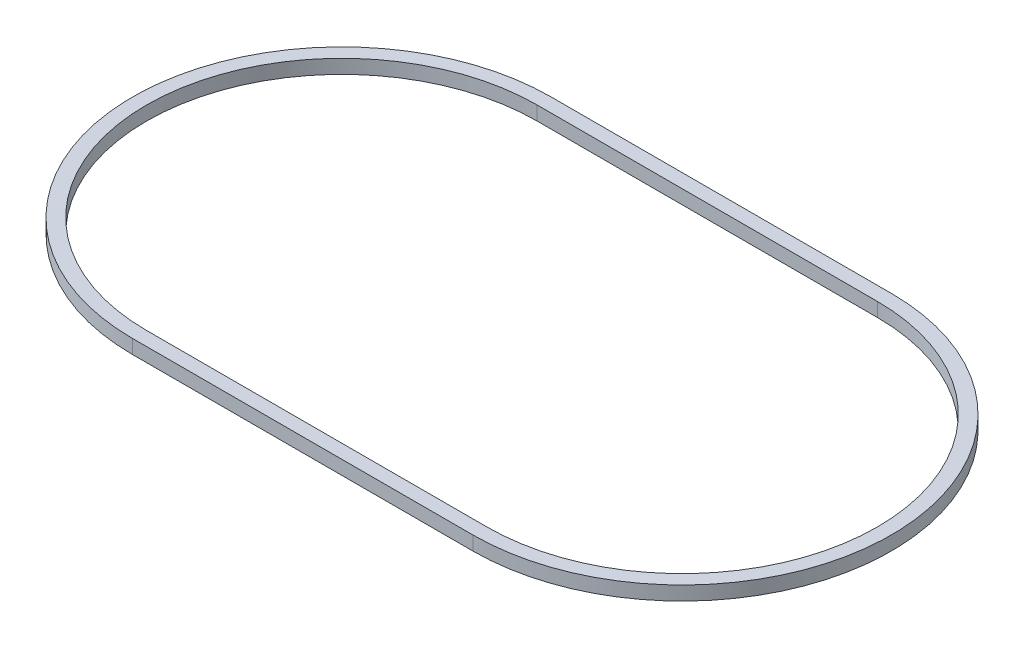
ISO-10303-21;
HEADER;
FILE_DESCRIPTION(('STEP AP214'),'2;1');
FILE_NAME('part.step','',(''),(''),'','','');
FILE_SCHEMA(('AUTOMOTIVE_DESIGN { 1 0 10303 214 1 1 1 1 }'));
ENDSEC;
DATA;
#1=APPLICATION_CONTEXT('core data for automotive mechanical design processes');
#2=APPLICATION_PROTOCOL_DEFINITION('international standard','automotive_design',2000,#1);
#3=PRODUCT_CONTEXT('',#1,'mechanical');
#4=PRODUCT('Part','Part','',(#3));
#5=PRODUCT_RELATED_PRODUCT_CATEGORY('part','',(#4));
#6=PRODUCT_DEFINITION_FORMATION('','',#4);
#7=PRODUCT_DEFINITION_CONTEXT('part definition',#1,'design');
#8=PRODUCT_DEFINITION('design','',#6,#7);
#9=PRODUCT_DEFINITION_SHAPE('','',#8);
#10=(LENGTH_UNIT() NAMED_UNIT(*) SI_UNIT(.MILLI.,.METRE.));
#11=(NAMED_UNIT(*) PLANE_ANGLE_UNIT() SI_UNIT($,.RADIAN.));
#12=(NAMED_UNIT(*) SI_UNIT($,.STERADIAN.) SOLID_ANGLE_UNIT());
#13=UNCERTAINTY_MEASURE_WITH_UNIT(LENGTH_MEASURE(1.E-05),#10,'distance_accuracy_value','');
#14=(GEOMETRIC_REPRESENTATION_CONTEXT(3) GLOBAL_UNCERTAINTY_ASSIGNED_CONTEXT((#13)) GLOBAL_UNIT_ASSIGNED_CONTEXT((#10,
#11,#12)) REPRESENTATION_CONTEXT('',''));
#15=CARTESIAN_POINT('',(0.,0.,0.));
#16=DIRECTION('',(0.,0.,1.));
#17=DIRECTION('',(1.,0.,0.));
#18=AXIS2_PLACEMENT_3D('',#15,#16,#17);
#19=CARTESIAN_POINT('',(30.5,2.5,0.));
#20=DIRECTION('',(0.,1.,0.));
#21=DIRECTION('',(0.,0.,1.));
#22=AXIS2_PLACEMENT_3D('',#19,#20,#21);
#23=PLANE('',#22);
#24=CARTESIAN_POINT('',(30.5,2.5,0.));
#25=DIRECTION('',(0.,1.,0.));
#26=DIRECTION('',(0.,0.,1.));
#27=AXIS2_PLACEMENT_3D('',#24,#25,#26);
#28=CIRCLE('',#27,37.5);
#29=CARTESIAN_POINT('',(30.5,2.5,37.5));
#30=VERTEX_POINT('',#29);
#31=CARTESIAN_POINT('',(30.5,2.5,-37.5));
#32=VERTEX_POINT('',#31);
#33=EDGE_CURVE('E153',#30,#32,#28,.T.);
#34=ORIENTED_EDGE('',*,*,#33,.T.);
#35=DIRECTION('',(-1.,0.,0.));
#36=VECTOR('',#35,1.);
#37=CARTESIAN_POINT('',(30.5,2.5,-37.5));
#38=LINE('',#37,#36);
#39=CARTESIAN_POINT('',(-30.5,2.5,-37.5));
#40=VERTEX_POINT('',#39);
#41=EDGE_CURVE('E157',#32,#40,#38,.T.);
#42=ORIENTED_EDGE('',*,*,#41,.T.);
#43=CARTESIAN_POINT('',(-30.5,2.5,0.));
#44=DIRECTION('',(0.,1.,0.));
#45=DIRECTION('',(0.,0.,1.));
#46=AXIS2_PLACEMENT_3D('',#43,#44,#45);
#47=CIRCLE('',#46,37.5);
#48=CARTESIAN_POINT('',(-30.5,2.5,37.5));
#49=VERTEX_POINT('',#48);
#50=EDGE_CURVE('E161',#40,#49,#47,.T.);
#51=ORIENTED_EDGE('',*,*,#50,.T.);
#52=DIRECTION('',(1.,0.,0.));
#53=VECTOR('',#52,1.);
#54=CARTESIAN_POINT('',(30.5,2.5,37.5));
#55=LINE('',#54,#53);
#56=EDGE_CURVE('E164',#49,#30,#55,.T.);
#57=ORIENTED_EDGE('',*,*,#56,.T.);
#58=EDGE_LOOP('',(#34,#42,#51,#57));
#59=FACE_BOUND('',#58,.T.);
#60=DIRECTION('',(-1.,0.,0.));
#61=VECTOR('',#60,1.);
#62=CARTESIAN_POINT('',(30.5,2.5,-35.));
#63=LINE('',#62,#61);
#64=CARTESIAN_POINT('',(30.5,2.5,-35.));
#65=VERTEX_POINT('',#64);
#66=CARTESIAN_POINT('',(-30.5,2.5,-35.));
#67=VERTEX_POINT('',#66);
#68=EDGE_CURVE('E114',#65,#67,#63,.T.);
#69=ORIENTED_EDGE('',*,*,#68,.F.);
#70=CARTESIAN_POINT('',(30.5,2.5,0.));
#71=DIRECTION('',(0.,1.,0.));
#72=DIRECTION('',(0.,0.,1.));
#73=AXIS2_PLACEMENT_3D('',#70,#71,#72);
#74=CIRCLE('',#73,35.);
#75=CARTESIAN_POINT('',(30.5,2.5,35.));
#76=VERTEX_POINT('',#75);
#77=EDGE_CURVE('E105',#76,#65,#74,.T.);
#78=ORIENTED_EDGE('',*,*,#77,.F.);
#79=DIRECTION('',(1.,0.,0.));
#80=VECTOR('',#79,1.);
#81=CARTESIAN_POINT('',(30.5,2.5,35.));
#82=LINE('',#81,#80);
#83=CARTESIAN_POINT('',(-30.5,2.5,35.));
#84=VERTEX_POINT('',#83);
#85=EDGE_CURVE('E131',#84,#76,#82,.T.);
#86=ORIENTED_EDGE('',*,*,#85,.F.);
#87=CARTESIAN_POINT('',(-30.5,2.5,0.));
#88=DIRECTION('',(0.,1.,0.));
#89=DIRECTION('',(0.,0.,1.));
#90=AXIS2_PLACEMENT_3D('',#87,#88,#89);
#91=CIRCLE('',#90,35.);
#92=EDGE_CURVE('E127',#67,#84,#91,.T.);
#93=ORIENTED_EDGE('',*,*,#92,.F.);
#94=EDGE_LOOP('',(#69,#78,#86,#93));
#95=FACE_BOUND('',#94,.T.);
#96=ADVANCED_FACE('F39',(#59,#95),#23,.T.);
#97=CARTESIAN_POINT('',(30.5,0.,0.));
#98=DIRECTION('',(0.,1.,0.));
#99=DIRECTION('',(0.,0.,1.));
#100=AXIS2_PLACEMENT_3D('',#97,#98,#99);
#101=PLANE('',#100);
#102=CARTESIAN_POINT('',(30.5,0.,0.));
#103=DIRECTION('',(0.,1.,0.));
#104=DIRECTION('',(0.,0.,1.));
#105=AXIS2_PLACEMENT_3D('',#102,#103,#104);
#106=CIRCLE('',#105,37.5);
#107=CARTESIAN_POINT('',(30.5,0.,37.5));
#108=VERTEX_POINT('',#107);
#109=CARTESIAN_POINT('',(30.5,0.,-37.5));
#110=VERTEX_POINT('',#109);
#111=EDGE_CURVE('E123',#108,#110,#106,.T.);
#112=ORIENTED_EDGE('',*,*,#111,.F.);
#113=DIRECTION('',(1.,0.,0.));
#114=VECTOR('',#113,1.);
#115=CARTESIAN_POINT('',(30.5,0.,37.5));
#116=LINE('',#115,#114);
#117=CARTESIAN_POINT('',(-30.5,0.,37.5));
#118=VERTEX_POINT('',#117);
#119=EDGE_CURVE('E158',#118,#108,#116,.T.);
#120=ORIENTED_EDGE('',*,*,#119,.F.);
#121=CARTESIAN_POINT('',(-30.5,0.,0.));
#122=DIRECTION('',(0.,1.,0.));
#123=DIRECTION('',(0.,0.,1.));
#124=AXIS2_PLACEMENT_3D('',#121,#122,#123);
#125=CIRCLE('',#124,37.5);
#126=CARTESIAN_POINT('',(-30.5,0.,-37.5));
#127=VERTEX_POINT('',#126);
#128=EDGE_CURVE('E174',#127,#118,#125,.T.);
#129=ORIENTED_EDGE('',*,*,#128,.F.);
#130=DIRECTION('',(-1.,0.,0.));
#131=VECTOR('',#130,1.);
#132=CARTESIAN_POINT('',(30.5,0.,-37.5));
#133=LINE('',#132,#131);
#134=EDGE_CURVE('E171',#110,#127,#133,.T.);
#135=ORIENTED_EDGE('',*,*,#134,.F.);
#136=EDGE_LOOP('',(#112,#120,#129,#135));
#137=FACE_BOUND('',#136,.T.);
#138=CARTESIAN_POINT('',(30.5,0.,0.));
#139=DIRECTION('',(0.,1.,0.));
#140=DIRECTION('',(0.,0.,1.));
#141=AXIS2_PLACEMENT_3D('',#138,#139,#140);
#142=CIRCLE('',#141,35.);
#143=CARTESIAN_POINT('',(30.5,0.,35.));
#144=VERTEX_POINT('',#143);
#145=CARTESIAN_POINT('',(30.5,0.,-35.));
#146=VERTEX_POINT('',#145);
#147=EDGE_CURVE('E63',#144,#146,#142,.T.);
#148=ORIENTED_EDGE('',*,*,#147,.T.);
#149=DIRECTION('',(-1.,0.,0.));
#150=VECTOR('',#149,1.);
#151=CARTESIAN_POINT('',(30.5,0.,-35.));
#152=LINE('',#151,#150);
#153=CARTESIAN_POINT('',(-30.5,0.,-35.));
#154=VERTEX_POINT('',#153);
#155=EDGE_CURVE('E121',#146,#154,#152,.T.);
#156=ORIENTED_EDGE('',*,*,#155,.T.);
#157=CARTESIAN_POINT('',(-30.5,0.,0.));
#158=DIRECTION('',(0.,1.,0.));
#159=DIRECTION('',(0.,0.,1.));
#160=AXIS2_PLACEMENT_3D('',#157,#158,#159);
#161=CIRCLE('',#160,35.);
#162=CARTESIAN_POINT('',(-30.5,0.,35.));
#163=VERTEX_POINT('',#162);
#164=EDGE_CURVE('E140',#154,#163,#161,.T.);
#165=ORIENTED_EDGE('',*,*,#164,.T.);
#166=DIRECTION('',(1.,0.,0.));
#167=VECTOR('',#166,1.);
#168=CARTESIAN_POINT('',(30.5,0.,35.));
#169=LINE('',#168,#167);
#170=EDGE_CURVE('E115',#163,#144,#169,.T.);
#171=ORIENTED_EDGE('',*,*,#170,.T.);
#172=EDGE_LOOP('',(#148,#156,#165,#171));
#173=FACE_BOUND('',#172,.T.);
#174=ADVANCED_FACE('F197',(#137,#173),#101,.F.);
#175=CARTESIAN_POINT('',(30.5,2.5,0.));
#176=DIRECTION('',(0.,-1.,0.));
#177=DIRECTION('',(0.,0.,-1.));
#178=AXIS2_PLACEMENT_3D('',#175,#176,#177);
#179=CYLINDRICAL_SURFACE('',#178,37.5);
#180=ORIENTED_EDGE('',*,*,#111,.T.);
#181=DIRECTION('',(0.,-1.,0.));
#182=VECTOR('',#181,1.);
#183=CARTESIAN_POINT('',(30.5,2.5,-37.5));
#184=LINE('',#183,#182);
#185=EDGE_CURVE('E11',#32,#110,#184,.T.);
#186=ORIENTED_EDGE('',*,*,#185,.F.);
#187=ORIENTED_EDGE('',*,*,#33,.F.);
#188=DIRECTION('',(0.,-1.,0.));
#189=VECTOR('',#188,1.);
#190=CARTESIAN_POINT('',(30.5,2.5,37.5));
#191=LINE('',#190,#189);
#192=EDGE_CURVE('E167',#30,#108,#191,.T.);
#193=ORIENTED_EDGE('',*,*,#192,.T.);
#194=EDGE_LOOP('',(#180,#186,#187,#193));
#195=FACE_BOUND('',#194,.T.);
#196=ADVANCED_FACE('F41',(#195),#179,.T.);
#197=CARTESIAN_POINT('',(30.5,2.5,-37.5));
#198=DIRECTION('',(0.,0.,1.));
#199=DIRECTION('',(1.,0.,0.));
#200=AXIS2_PLACEMENT_3D('',#197,#198,#199);
#201=PLANE('',#200);
#202=ORIENTED_EDGE('',*,*,#134,.T.);
#203=DIRECTION('',(0.,-1.,0.));
#204=VECTOR('',#203,1.);
#205=CARTESIAN_POINT('',(-30.5,2.5,-37.5));
#206=LINE('',#205,#204);
#207=EDGE_CURVE('E48',#40,#127,#206,.T.);
#208=ORIENTED_EDGE('',*,*,#207,.F.);
#209=ORIENTED_EDGE('',*,*,#41,.F.);
#210=ORIENTED_EDGE('',*,*,#185,.T.);
#211=EDGE_LOOP('',(#202,#208,#209,#210));
#212=FACE_BOUND('',#211,.T.);
#213=ADVANCED_FACE('F207',(#212),#201,.F.);
#214=CARTESIAN_POINT('',(-30.5,2.5,0.));
#215=DIRECTION('',(0.,-1.,0.));
#216=DIRECTION('',(0.,0.,-1.));
#217=AXIS2_PLACEMENT_3D('',#214,#215,#216);
#218=CYLINDRICAL_SURFACE('',#217,37.5);
#219=ORIENTED_EDGE('',*,*,#128,.T.);
#220=DIRECTION('',(0.,-1.,0.));
#221=VECTOR('',#220,1.);
#222=CARTESIAN_POINT('',(-30.5,2.5,37.5));
#223=LINE('',#222,#221);
#224=EDGE_CURVE('E182',#49,#118,#223,.T.);
#225=ORIENTED_EDGE('',*,*,#224,.F.);
#226=ORIENTED_EDGE('',*,*,#50,.F.);
#227=ORIENTED_EDGE('',*,*,#207,.T.);
#228=EDGE_LOOP('',(#219,#225,#226,#227));
#229=FACE_BOUND('',#228,.T.);
#230=ADVANCED_FACE('F191',(#229),#218,.T.);
#231=CARTESIAN_POINT('',(30.5,2.5,37.5));
#232=DIRECTION('',(0.,0.,-1.));
#233=DIRECTION('',(-1.,0.,0.));
#234=AXIS2_PLACEMENT_3D('',#231,#232,#233);
#235=PLANE('',#234);
#236=ORIENTED_EDGE('',*,*,#119,.T.);
#237=ORIENTED_EDGE('',*,*,#192,.F.);
#238=ORIENTED_EDGE('',*,*,#56,.F.);
#239=ORIENTED_EDGE('',*,*,#224,.T.);
#240=EDGE_LOOP('',(#236,#237,#238,#239));
#241=FACE_BOUND('',#240,.T.);
#242=ADVANCED_FACE('F201',(#241),#235,.F.);
#243=CARTESIAN_POINT('',(30.5,2.5,0.));
#244=DIRECTION('',(0.,-1.,0.));
#245=DIRECTION('',(0.,0.,-1.));
#246=AXIS2_PLACEMENT_3D('',#243,#244,#245);
#247=CYLINDRICAL_SURFACE('',#246,35.);
#248=ORIENTED_EDGE('',*,*,#147,.F.);
#249=DIRECTION('',(0.,-1.,0.));
#250=VECTOR('',#249,1.);
#251=CARTESIAN_POINT('',(30.5,2.5,35.));
#252=LINE('',#251,#250);
#253=EDGE_CURVE('E109',#76,#144,#252,.T.);
#254=ORIENTED_EDGE('',*,*,#253,.F.);
#255=ORIENTED_EDGE('',*,*,#77,.T.);
#256=DIRECTION('',(0.,-1.,0.));
#257=VECTOR('',#256,1.);
#258=CARTESIAN_POINT('',(30.5,2.5,-35.));
#259=LINE('',#258,#257);
#260=EDGE_CURVE('E108',#65,#146,#259,.T.);
#261=ORIENTED_EDGE('',*,*,#260,.T.);
#262=EDGE_LOOP('',(#248,#254,#255,#261));
#263=FACE_BOUND('',#262,.T.);
#264=ADVANCED_FACE('F107',(#263),#247,.F.);
#265=CARTESIAN_POINT('',(30.5,2.5,-35.));
#266=DIRECTION('',(0.,0.,1.));
#267=DIRECTION('',(1.,0.,0.));
#268=AXIS2_PLACEMENT_3D('',#265,#266,#267);
#269=PLANE('',#268);
#270=ORIENTED_EDGE('',*,*,#155,.F.);
#271=ORIENTED_EDGE('',*,*,#260,.F.);
#272=ORIENTED_EDGE('',*,*,#68,.T.);
#273=DIRECTION('',(0.,-1.,0.));
#274=VECTOR('',#273,1.);
#275=CARTESIAN_POINT('',(-30.5,2.5,-35.));
#276=LINE('',#275,#274);
#277=EDGE_CURVE('E124',#67,#154,#276,.T.);
#278=ORIENTED_EDGE('',*,*,#277,.T.);
#279=EDGE_LOOP('',(#270,#271,#272,#278));
#280=FACE_BOUND('',#279,.T.);
#281=ADVANCED_FACE('F118',(#280),#269,.T.);
#282=CARTESIAN_POINT('',(-30.5,2.5,0.));
#283=DIRECTION('',(0.,-1.,0.));
#284=DIRECTION('',(0.,0.,-1.));
#285=AXIS2_PLACEMENT_3D('',#282,#283,#284);
#286=CYLINDRICAL_SURFACE('',#285,35.);
#287=ORIENTED_EDGE('',*,*,#164,.F.);
#288=ORIENTED_EDGE('',*,*,#277,.F.);
#289=ORIENTED_EDGE('',*,*,#92,.T.);
#290=DIRECTION('',(0.,-1.,0.));
#291=VECTOR('',#290,1.);
#292=CARTESIAN_POINT('',(-30.5,2.5,35.));
#293=LINE('',#292,#291);
#294=EDGE_CURVE('E55',#84,#163,#293,.T.);
#295=ORIENTED_EDGE('',*,*,#294,.T.);
#296=EDGE_LOOP('',(#287,#288,#289,#295));
#297=FACE_BOUND('',#296,.T.);
#298=ADVANCED_FACE('F230',(#297),#286,.F.);
#299=CARTESIAN_POINT('',(30.5,2.5,35.));
#300=DIRECTION('',(0.,0.,-1.));
#301=DIRECTION('',(-1.,0.,0.));
#302=AXIS2_PLACEMENT_3D('',#299,#300,#301);
#303=PLANE('',#302);
#304=ORIENTED_EDGE('',*,*,#170,.F.);
#305=ORIENTED_EDGE('',*,*,#294,.F.);
#306=ORIENTED_EDGE('',*,*,#85,.T.);
#307=ORIENTED_EDGE('',*,*,#253,.T.);
#308=EDGE_LOOP('',(#304,#305,#306,#307));
#309=FACE_BOUND('',#308,.T.);
#310=ADVANCED_FACE('F234',(#309),#303,.T.);
#311=CLOSED_SHELL('',(#96,#174,#196,#213,#230,#242,#264,#281,#298,#310));
#312=MANIFOLD_SOLID_BREP('B2',#311);
#313=ADVANCED_BREP_SHAPE_REPRESENTATION('',(#18,#312),#14);
#314=SHAPE_DEFINITION_REPRESENTATION(#9,#313);
ENDSEC;
END-ISO-10303-21;
